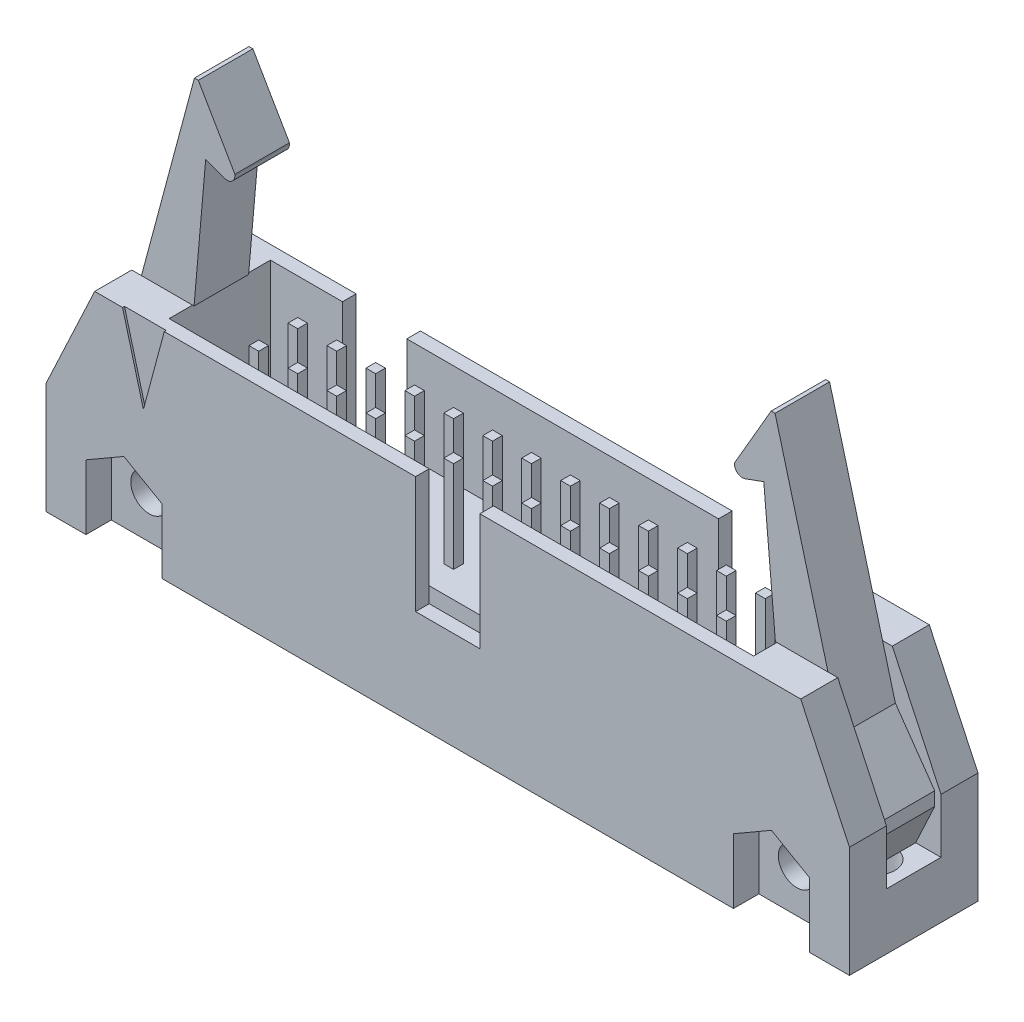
from build123d import *

# Parameters (mm, degrees)
SKETCH1_W                = 52.3748
SKETCH1_H                = 14.0208
BASE_EXTRUDE_DEPTH       = 8.382
ANGLE_CUT_OUTSIDE_DEPTH  = 55.863106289
SKETCH3_W                = 38.1
SKETCH3_H                = 6.604
INSIDE_CUT1_DEPTH        = 6.604
SKETCH4_W                = 4.191
SKETCH4_H                = 7.62
CENTER_CUT1_DEPTH        = 0.889
SKETCH5_W                = 0.635
SKETCH5_H                = 0.635
PIN_1_BOSS_DEPTH         = 5.969
F_26P_PATTERN_COUNT      = 13
F_26P_PATTERN_PITCH      = 2.54
F_26P_PATTERN_COUNT_DIR2 = 2
F_26P_PATTERN_PITCH_DIR2 = 2.54
SKETCH6_W                = 4.191
SKETCH6_H                = 7.62
REAR_CUT1_DEPTH          = 0.889
LATCHES_DEPTH            = 3.556
LATCH_CUT1_DEPTH         = 3.556
PIN_1_TRIANGLE_CUT_DEPTH = 0.127
SCREW_RECESS_DEPTH       = 1.651
SKETCH12_R               = 1.2065
SCREW_HOLE_DEPTH         = 60.473221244
SKETCH13_R               = 1.27
VERT_MNT_HOLE_DEPTH      = 3.683
SKETCH15_W               = 34.544
SKETCH15_H               = 4.318
R_ANG_REAR_CUT1_DEPTH    = 1.524


with BuildPart() as part:
    # Sketch1 → Base-Extrude (new body)
    with BuildSketch(Plane.XY):
        with Locations((26.1874, 7.0104)):
            Rectangle(SKETCH1_W, SKETCH1_H)
    extrude(amount=-BASE_EXTRUDE_DEPTH)

    # Sketch2 → Angle Cut Outside (cut, through all)
    with BuildSketch(Plane.XY):
        Polygon((3.175, 14.0208), (0, 7.239), (0, 14.0208), align=None)
        Polygon((52.3748, 14.0208), (49.1998, 14.0208), (52.3748, 7.239), align=None)
    extrude(amount=-ANGLE_CUT_OUTSIDE_DEPTH, mode=Mode.SUBTRACT)

    # Sketch3 → Inside Cut1 (cut)
    with BuildSketch(Plane(origin=(0, 14.0208, 0), x_dir=(-1, 0, 0), z_dir=(0, 1, 0))):
        with Locations((-26.1874, -4.191)):
            Rectangle(SKETCH3_W, SKETCH3_H)
    extrude(amount=-INSIDE_CUT1_DEPTH, mode=Mode.SUBTRACT)

    # Sketch4 → Center Cut1 (cut)
    with BuildSketch(Plane.XY):
        with Locations((26.1874, 10.2108)):
            Rectangle(SKETCH4_W, SKETCH4_H)
    extrude(amount=-CENTER_CUT1_DEPTH, mode=Mode.SUBTRACT)

    # Sketch5 → Pin 1 Boss (add)
    with BuildSketch(Plane(origin=(0, 7.4168, 0), x_dir=(-1, 0, 0), z_dir=(0, 1, 0))):
        with Locations((-10.9474, -2.921)):
            Rectangle(SKETCH5_W, SKETCH5_H)
    pin_1_boss = extrude(amount=PIN_1_BOSS_DEPTH)

    # 26p Pattern: Pin 1 Boss 13 × 2
    with Locations(*[(i * F_26P_PATTERN_PITCH, 0, -j * F_26P_PATTERN_PITCH_DIR2) for i in range(F_26P_PATTERN_COUNT) for j in range(F_26P_PATTERN_COUNT_DIR2) if (i, j) != (0, 0)]):
        add(pin_1_boss)

    # Sketch6 → Rear Cut1 (cut)
    with BuildSketch(Plane(origin=(0, 0, -8.382), x_dir=(-1, 0, 0), z_dir=(0, 0, -1))):
        with Locations((-38.4429, 10.2108)):
            Rectangle(SKETCH6_W, SKETCH6_H)
        with Locations((-13.9319, 10.2108)):
            Rectangle(SKETCH6_W, SKETCH6_H)
    extrude(amount=-REAR_CUT1_DEPTH, mode=Mode.SUBTRACT)

    # Sketch7 → Latches (add)
    with BuildSketch(Plane.XY.offset(-2.413)):
        with BuildLine():
            Line((44.379073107, 22.67022796), (45.1358, 14.0208))
            Line((45.1358, 14.0208), (48.5648, 14.0208))
            Line((48.5648, 14.0208), (45.113448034, 26.901420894))
            Line((45.113448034, 26.901420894), (44.859448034, 26.901420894))
            Line((44.859448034, 26.901420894), (42.474073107, 22.787768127))
            Line((42.474073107, 22.787768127), (42.474073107, 22.702363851))
            ThreePointArc((42.474073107, 22.702363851), (42.690696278, 22.286234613), (43.15581934, 22.225))
            Line((43.15581934, 22.225), (44.379073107, 22.67022796))
        make_face()
        with BuildLine():
            Line((7.239, 14.0208), (3.81, 14.0208))
            Line((3.81, 14.0208), (7.261351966, 26.901420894))
            Line((7.261351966, 26.901420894), (7.515351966, 26.901420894))
            Line((7.515351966, 26.901420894), (9.900726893, 22.787768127))
            Line((9.900726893, 22.787768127), (9.900726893, 22.702363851))
            ThreePointArc((9.900726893, 22.702363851), (9.684103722, 22.286234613), (9.21898066, 22.225))
            Line((9.21898066, 22.225), (7.995726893, 22.67022796))
            Line((7.995726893, 22.67022796), (7.239, 14.0208))
        make_face()
    extrude(amount=-LATCHES_DEPTH)

    # Sketch8 → Latch Cut1 (cut)
    with BuildSketch(Plane.XY.offset(-2.413)):
        Polygon((3.81, 14.0208), (2.974670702, 10.903308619), (0.408894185, 7.239), (0.408894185, 6.35), (1.652536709, 3.683), (0, 3.683), (0, 7.239), (3.175, 14.0208), align=None)
        Polygon((48.5648, 14.0208), (49.1998, 14.0208), (52.3748, 7.239), (52.3748, 3.683), (50.722263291, 3.683), (51.965905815, 6.35), (51.965905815, 7.239), (49.400129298, 10.903308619), align=None)
    extrude(amount=-LATCH_CUT1_DEPTH, mode=Mode.SUBTRACT)

    # Sketch9 → Pin 1 Triangle Cut (cut)
    with BuildSketch(Plane.XY):
        Polygon((4.988818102, 14.0208), (6.35, 8.9408), (7.711181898, 14.0208), align=None)
    extrude(amount=-PIN_1_TRIANGLE_CUT_DEPTH, mode=Mode.SUBTRACT)

    # Sketch10 → Screw Recess (cut)
    with BuildSketch(Plane.XY):
        Polygon((7.5565, 0), (7.5565, 4.223807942), (5.08, 5.653615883), (2.6035, 4.223807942), (2.6035, 0), align=None)
        Polygon((49.7713, 0), (44.8183, 0), (44.8183, 4.223807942), (47.2948, 5.653615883), (49.7713, 4.223807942), align=None)
    extrude(amount=-SCREW_RECESS_DEPTH, mode=Mode.SUBTRACT)

    # Sketch12 → Screw Hole (cut, through all)
    with BuildSketch(Plane.XY):
        with Locations((5.08, 2.794)):
            Circle(SKETCH12_R)
        with Locations(Location((47.2948, 2.794, 0), (0, 0, 180))):
            Circle(SKETCH12_R)
    extrude(amount=-SCREW_HOLE_DEPTH, mode=Mode.SUBTRACT)

    # Sketch13 → Vert Mnt Hole (cut)
    with BuildSketch(Plane.XZ):
        with Locations(Location((2.032, -3.7338, 0), (0, 0, 270))):
            Circle(SKETCH13_R)
        with Locations(Location((50.3428, -3.7338, 0), (0, 0, 287.384941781))):
            Circle(SKETCH13_R)
    extrude(amount=-VERT_MNT_HOLE_DEPTH, mode=Mode.SUBTRACT)

    # Sketch15 → R Ang Rear Cut1 (cut)
    with BuildSketch(Plane(origin=(0, 0, -8.382), x_dir=(-1, 0, 0), z_dir=(0, 0, -1))):
        with Locations((-26.1874, 2.159)):
            Rectangle(SKETCH15_W, SKETCH15_H)
    extrude(amount=-R_ANG_REAR_CUT1_DEPTH, mode=Mode.SUBTRACT)


solid = part.part
